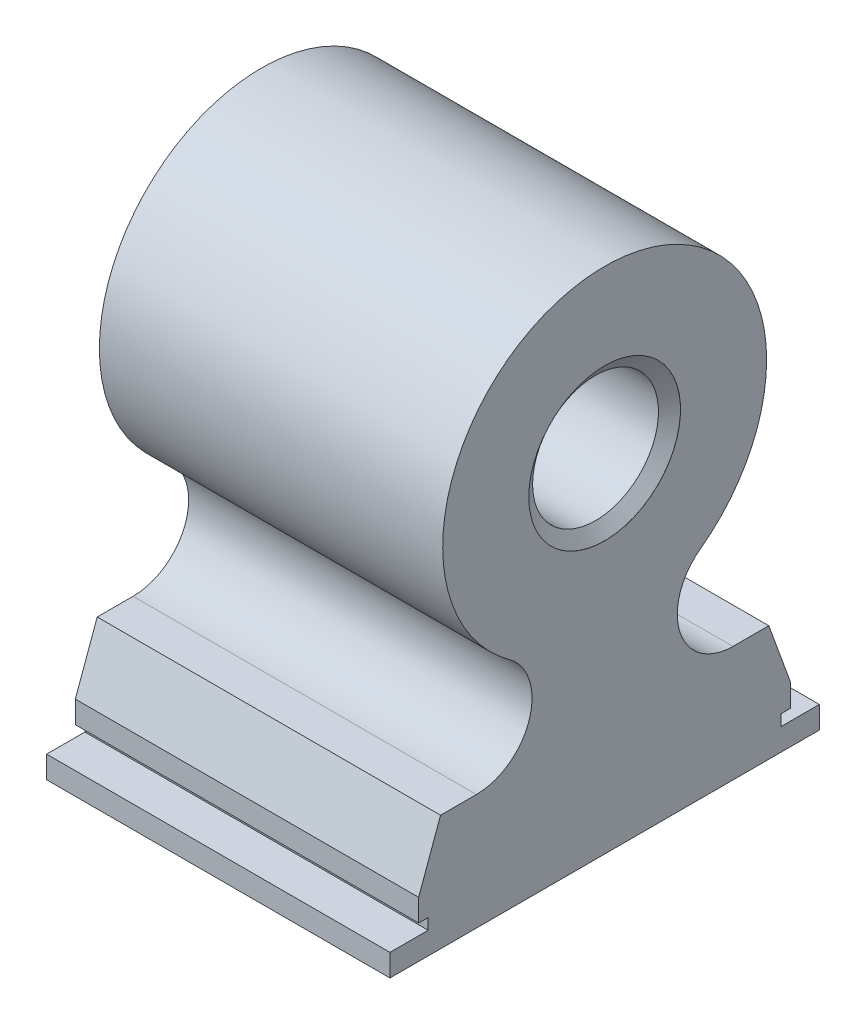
from build123d import *

# Parameters (mm, degrees)
BODYSKE_R  = 1.7272
BODY_DEPTH = 9.4234


with BuildPart() as part:
    # BodySke → Body (new body)
    with BuildSketch(Plane(origin=(0, 0, 0), x_dir=(0, 0, -1), z_dir=(1, 0, 0))):
        with BuildLine():
            Line((-5.8928, -9.525), (5.8928, -9.525))
            Line((5.8928, -9.525), (5.8928, -8.9154))
            Line((5.8928, -8.9154), (4.842933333, -8.9154))
            Line((4.842933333, -8.9154), (4.842933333, -8.6106))
            Line((4.842933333, -8.6106), (5.1054, -8.6106))
            Line((5.1054, -8.6106), (5.1054, -8.001))
            Line((5.1054, -8.001), (4.504485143, -6.35))
            Line((4.504485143, -6.35), (3.520438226, -6.35))
            ThreePointArc((3.520438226, -6.35), (2.069125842, -5.296760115), (2.620488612, -3.59041285))
            ThreePointArc((2.620488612, -3.59041285), (0, 4.445), (-2.620488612, -3.59041285))
            ThreePointArc((-2.620488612, -3.59041285), (-2.069125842, -5.296760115), (-3.520438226, -6.35))
            Line((-3.520438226, -6.35), (-4.504485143, -6.35))
            Line((-4.504485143, -6.35), (-5.1054, -8.001))
            Line((-5.1054, -8.001), (-5.1054, -8.6106))
            Line((-5.1054, -8.6106), (-4.842933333, -8.6106))
            Line((-4.842933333, -8.6106), (-4.842933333, -8.9154))
            Line((-4.842933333, -8.9154), (-5.8928, -8.9154))
            Line((-5.8928, -8.9154), (-5.8928, -9.525))
        make_face()
        Circle(BODYSKE_R, mode=Mode.SUBTRACT)
    extrude(amount=BODY_DEPTH)

    # EndChamferSke → EndChamfer (revolve, cut)
    with BuildSketch(Plane.XY, mode=Mode.PRIVATE) as endchamfer_sk:
        Polygon((-0.254, 2.0828), (0.00254, 2.0828), (0.251441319, 1.7272), (-0.254, 1.7272), align=None)
        Polygon((9.6774, 2.0828), (9.42086, 2.0828), (9.171958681, 1.7272), (9.6774, 1.7272), align=None)
    revolve(endchamfer_sk.sketch.rotate(Axis((-5.105879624, 0, 0), (1, 0, 0)), 90), axis=Axis((-5.105879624, 0, 0), (1, 0, 0)), mode=Mode.SUBTRACT)


solid = part.part
